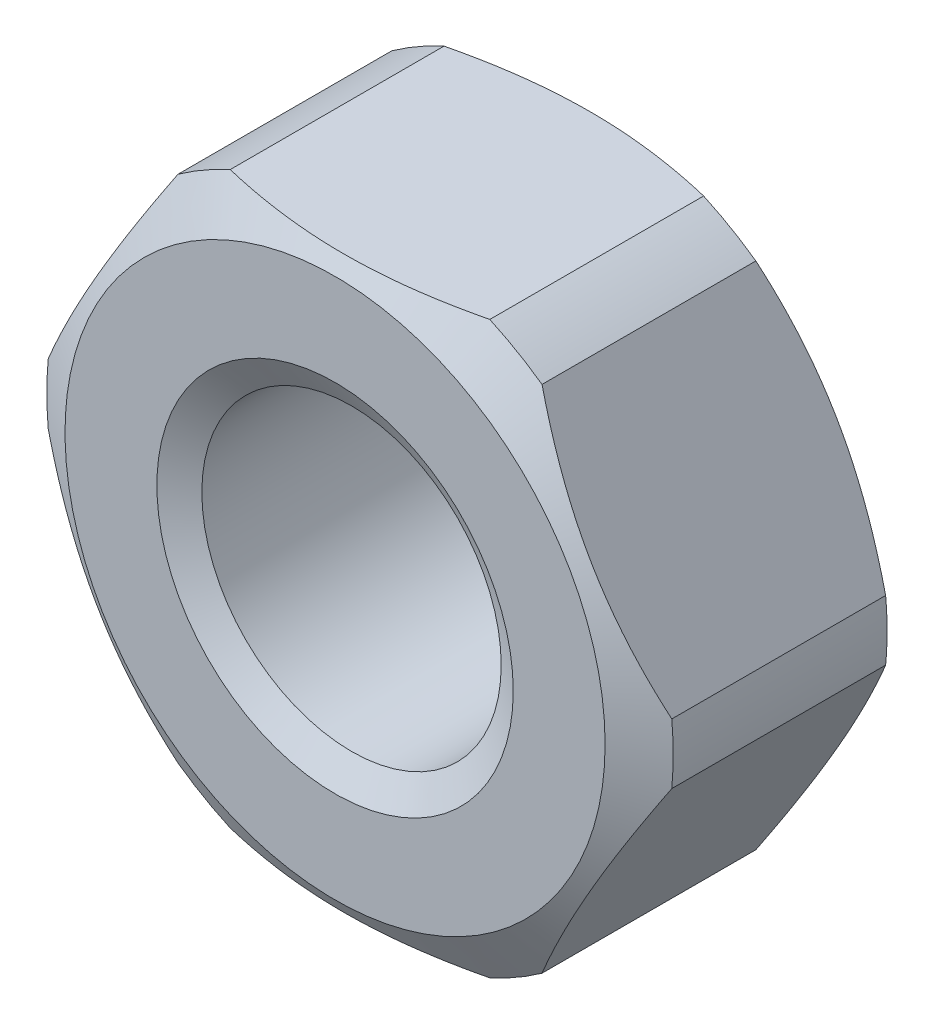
ISO-10303-21;
HEADER;
FILE_DESCRIPTION(('STEP AP214'),'2;1');
FILE_NAME('part.step','',(''),(''),'','','');
FILE_SCHEMA(('AUTOMOTIVE_DESIGN { 1 0 10303 214 1 1 1 1 }'));
ENDSEC;
DATA;
#1=APPLICATION_CONTEXT('core data for automotive mechanical design processes');
#2=APPLICATION_PROTOCOL_DEFINITION('international standard','automotive_design',2000,#1);
#3=PRODUCT_CONTEXT('',#1,'mechanical');
#4=PRODUCT('Part','Part','',(#3));
#5=PRODUCT_RELATED_PRODUCT_CATEGORY('part','',(#4));
#6=PRODUCT_DEFINITION_FORMATION('','',#4);
#7=PRODUCT_DEFINITION_CONTEXT('part definition',#1,'design');
#8=PRODUCT_DEFINITION('design','',#6,#7);
#9=PRODUCT_DEFINITION_SHAPE('','',#8);
#10=(LENGTH_UNIT() NAMED_UNIT(*) SI_UNIT(.MILLI.,.METRE.));
#11=(NAMED_UNIT(*) PLANE_ANGLE_UNIT() SI_UNIT($,.RADIAN.));
#12=(NAMED_UNIT(*) SI_UNIT($,.STERADIAN.) SOLID_ANGLE_UNIT());
#13=UNCERTAINTY_MEASURE_WITH_UNIT(LENGTH_MEASURE(1.E-05),#10,'distance_accuracy_value','');
#14=(GEOMETRIC_REPRESENTATION_CONTEXT(3) GLOBAL_UNCERTAINTY_ASSIGNED_CONTEXT((#13)) GLOBAL_UNIT_ASSIGNED_CONTEXT((#10,
#11,#12)) REPRESENTATION_CONTEXT('',''));
#15=CARTESIAN_POINT('',(0.,0.,0.));
#16=DIRECTION('',(0.,0.,1.));
#17=DIRECTION('',(1.,0.,0.));
#18=AXIS2_PLACEMENT_3D('',#15,#16,#17);
#19=CARTESIAN_POINT('',(0.,0.,-3.7));
#20=DIRECTION('',(0.,0.,1.));
#21=DIRECTION('',(1.,0.,0.));
#22=AXIS2_PLACEMENT_3D('',#19,#20,#21);
#23=CONICAL_SURFACE('',#22,3.78878221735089,1.0471975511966);
#24=CARTESIAN_POINT('',(0.,0.,-3.7));
#25=DIRECTION('',(0.,0.,1.));
#26=DIRECTION('',(1.,0.,0.));
#27=AXIS2_PLACEMENT_3D('',#24,#25,#26);
#28=CIRCLE('',#27,3.78878221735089);
#29=CARTESIAN_POINT('',(3.78878221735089,0.,-3.7));
#30=VERTEX_POINT('',#29);
#31=EDGE_CURVE('E162',#30,#30,#28,.T.);
#32=ORIENTED_EDGE('',*,*,#31,.T.);
#33=EDGE_LOOP('',(#32));
#34=FACE_BOUND('',#33,.T.);
#35=CARTESIAN_POINT('',(-6.09010462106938,-4.,-1.68073860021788));
#36=CARTESIAN_POINT('',(-5.91474984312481,-4.,-1.76533469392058));
#37=CARTESIAN_POINT('',(-5.73897650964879,-4.,-1.84907910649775));
#38=CARTESIAN_POINT('',(-5.38636624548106,-4.,-2.01437706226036));
#39=CARTESIAN_POINT('',(-5.20952913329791,-4.,-2.09593021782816));
#40=CARTESIAN_POINT('',(-4.8535922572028,-4.,-2.25679540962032));
#41=CARTESIAN_POINT('',(-4.67448531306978,-4.,-2.33609161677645));
#42=CARTESIAN_POINT('',(-4.31478640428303,-4.,-2.49122759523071));
#43=CARTESIAN_POINT('',(-4.13419451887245,-4.,-2.56706754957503));
#44=CARTESIAN_POINT('',(-3.76915945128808,-4.,-2.71520441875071));
#45=CARTESIAN_POINT('',(-3.58469582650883,-4.,-2.78745123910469));
#46=CARTESIAN_POINT('',(-3.21358050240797,-4.,-2.92619920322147));
#47=CARTESIAN_POINT('',(-3.02692856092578,-4.,-2.99269970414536));
#48=CARTESIAN_POINT('',(-2.65153478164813,-4.,-3.11814272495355));
#49=CARTESIAN_POINT('',(-2.46279847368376,-4.,-3.17710162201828));
#50=CARTESIAN_POINT('',(-2.08264462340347,-4.,-3.28552421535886));
#51=CARTESIAN_POINT('',(-1.89122795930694,-4.,-3.33499094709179));
#52=CARTESIAN_POINT('',(-1.50556889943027,-4.,-3.4220090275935));
#53=CARTESIAN_POINT('',(-1.31132534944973,-4.,-3.45955535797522));
#54=CARTESIAN_POINT('',(-0.920535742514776,-4.,-3.52017523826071));
#55=CARTESIAN_POINT('',(-0.723989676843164,-4.,-3.54324873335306));
#56=CARTESIAN_POINT('',(-0.330842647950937,-4.,-3.57288099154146));
#57=CARTESIAN_POINT('',(-0.134249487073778,-4.,-3.57954064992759));
#58=CARTESIAN_POINT('',(0.258741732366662,-4.,-3.57600684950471));
#59=CARTESIAN_POINT('',(0.455139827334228,-4.,-3.56581758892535));
#60=CARTESIAN_POINT('',(0.791541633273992,-4.,-3.53464466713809));
#61=CARTESIAN_POINT('',(0.931919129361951,-4.,-3.51748812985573));
#62=CARTESIAN_POINT('',(1.2115657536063,-4.,-3.47570112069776));
#63=CARTESIAN_POINT('',(1.35083470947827,-4.,-3.45106950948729));
#64=CARTESIAN_POINT('',(1.76720669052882,-4.,-3.36719032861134));
#65=CARTESIAN_POINT('',(2.04232775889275,-4.,-3.29801551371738));
#66=CARTESIAN_POINT('',(2.45379715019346,-4.,-3.17903567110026));
#67=CARTESIAN_POINT('',(2.5923011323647,-4.,-3.13626919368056));
#68=CARTESIAN_POINT('',(2.86797080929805,-4.,-3.04654496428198));
#69=CARTESIAN_POINT('',(3.00513638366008,-4.,-2.99958683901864));
#70=CARTESIAN_POINT('',(3.27744406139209,-4.,-2.90248009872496));
#71=CARTESIAN_POINT('',(3.41259322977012,-4.,-2.85235109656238));
#72=CARTESIAN_POINT('',(3.68174668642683,-4.,-2.74923724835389));
#73=CARTESIAN_POINT('',(3.81575135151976,-4.,-2.69625338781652));
#74=CARTESIAN_POINT('',(3.94927494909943,-4.,-2.64211045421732));
#75=B_SPLINE_CURVE_WITH_KNOTS('',3,(#35,#36,#37,#38,#39,#40,#41,#42,#43,#44,#45,#46,#47,#48,#49,
#50,#51,#52,#53,#54,#55,#56,#57,#58,#59,#60,#61,#62,#63,#64,#65,#66,#67,#68,#69,#70,#71,#72,#73,
#74),.UNSPECIFIED.,.F.,.F.,(4,2,2,2,2,2,2,2,2,2,2,2,2,2,2,2,2,2,2,4),(0.,0.584090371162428,
1.16828339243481,1.7558806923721,2.34344683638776,2.93769425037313,3.53200805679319,
4.12500852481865,4.71781904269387,5.31087879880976,5.90394080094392,6.49334807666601,
7.08260851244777,7.50666702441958,7.93079020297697,8.78067929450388,9.21551481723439,
9.65038910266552,10.0827961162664,10.5150548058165),.UNSPECIFIED.);
#76=CARTESIAN_POINT('',(-1.82099560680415,-4.,-3.35));
#77=VERTEX_POINT('',#76);
#78=CARTESIAN_POINT('',(1.82099560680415,-4.,-3.35));
#79=VERTEX_POINT('',#78);
#80=EDGE_CURVE('E318',#77,#79,#75,.T.);
#81=ORIENTED_EDGE('',*,*,#80,.F.);
#82=CARTESIAN_POINT('',(0.,0.,-3.35));
#83=DIRECTION('',(0.,0.,1.));
#84=DIRECTION('',(1.,0.,0.));
#85=AXIS2_PLACEMENT_3D('',#82,#83,#84);
#86=CIRCLE('',#85,4.395);
#87=CARTESIAN_POINT('',(-2.55360381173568,-3.57702845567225,-3.35));
#88=VERTEX_POINT('',#87);
#89=EDGE_CURVE('E306',#88,#77,#86,.T.);
#90=ORIENTED_EDGE('',*,*,#89,.F.);
#91=CARTESIAN_POINT('',(-4.37501737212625,-0.422247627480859,-3.3498));
#92=CARTESIAN_POINT('',(-4.32612550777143,-0.506930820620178,-3.37319909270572));
#93=CARTESIAN_POINT('',(-4.27705778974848,-0.591918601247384,-3.39512338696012));
#94=CARTESIAN_POINT('',(-4.17857058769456,-0.762503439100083,-3.43569438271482));
#95=CARTESIAN_POINT('',(-4.12915100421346,-0.848100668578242,-3.45434011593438));
#96=CARTESIAN_POINT('',(-3.98032099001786,-1.10588181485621,-3.50487711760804));
#97=CARTESIAN_POINT('',(-3.88042496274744,-1.27890680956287,-3.53132603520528));
#98=CARTESIAN_POINT('',(-3.68182029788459,-1.62290017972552,-3.56711618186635));
#99=CARTESIAN_POINT('',(-3.5831263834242,-1.79384305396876,-3.57678031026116));
#100=CARTESIAN_POINT('',(-3.38575172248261,-2.13570599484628,-3.57908761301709));
#101=CARTESIAN_POINT('',(-3.28707102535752,-2.30662597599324,-3.57174400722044));
#102=CARTESIAN_POINT('',(-3.13547487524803,-2.56919821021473,-3.54788416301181));
#103=CARTESIAN_POINT('',(-3.08231309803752,-2.66127710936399,-3.53711457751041));
#104=CARTESIAN_POINT('',(-2.97625782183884,-2.84497023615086,-3.51109560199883));
#105=CARTESIAN_POINT('',(-2.92336434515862,-2.93658442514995,-3.49584584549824));
#106=CARTESIAN_POINT('',(-2.81734845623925,-3.12020933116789,-3.46102286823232));
#107=CARTESIAN_POINT('',(-2.76422979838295,-3.21221354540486,-3.44140448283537));
#108=CARTESIAN_POINT('',(-2.6583990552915,-3.39551776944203,-3.39835775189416));
#109=CARTESIAN_POINT('',(-2.60568682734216,-3.48681802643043,-3.37493081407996));
#110=CARTESIAN_POINT('',(-2.55318585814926,-3.57775237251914,-3.3498));
#111=B_SPLINE_CURVE_WITH_KNOTS('',3,(#91,#92,#93,#94,#95,#96,#97,#98,#99,#100,#101,#102,#103,
#104,#105,#106,#107,#108,#109,#110),.UNSPECIFIED.,.F.,.F.,(4,2,2,2,2,2,2,2,2,4),(0.,
0.301613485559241,0.603315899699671,1.20724889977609,1.79942937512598,2.39114971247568,
2.71167001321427,3.03221654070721,3.35624503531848,3.68015403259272),.UNSPECIFIED.);
#112=CARTESIAN_POINT('',(-4.37459941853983,-0.422971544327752,-3.35));
#113=VERTEX_POINT('',#112);
#114=EDGE_CURVE('E242',#113,#88,#111,.T.);
#115=ORIENTED_EDGE('',*,*,#114,.F.);
#116=CARTESIAN_POINT('',(-4.37459941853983,0.422971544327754,-3.35));
#117=VERTEX_POINT('',#116);
#118=EDGE_CURVE('E304',#117,#113,#86,.T.);
#119=ORIENTED_EDGE('',*,*,#118,.F.);
#120=CARTESIAN_POINT('',(-2.55318585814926,3.57775237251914,-3.3498));
#121=CARTESIAN_POINT('',(-2.60207772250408,3.49306917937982,-3.37319909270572));
#122=CARTESIAN_POINT('',(-2.65114544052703,3.40808139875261,-3.39512338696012));
#123=CARTESIAN_POINT('',(-2.74963264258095,3.23749656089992,-3.43569438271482));
#124=CARTESIAN_POINT('',(-2.79905222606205,3.15189933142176,-3.45434011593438));
#125=CARTESIAN_POINT('',(-2.94788224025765,2.89411818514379,-3.50487711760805));
#126=CARTESIAN_POINT('',(-3.04777826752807,2.72109319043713,-3.53132603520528));
#127=CARTESIAN_POINT('',(-3.24638293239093,2.37709982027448,-3.56711618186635));
#128=CARTESIAN_POINT('',(-3.34507684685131,2.20615694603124,-3.57678031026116));
#129=CARTESIAN_POINT('',(-3.5424515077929,1.86429400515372,-3.57908761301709));
#130=CARTESIAN_POINT('',(-3.64113220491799,1.69337402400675,-3.57174400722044));
#131=CARTESIAN_POINT('',(-3.79272835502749,1.43080178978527,-3.5478841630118));
#132=CARTESIAN_POINT('',(-3.84589013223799,1.33872289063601,-3.53711457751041));
#133=CARTESIAN_POINT('',(-3.95194540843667,1.15502976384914,-3.51109560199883));
#134=CARTESIAN_POINT('',(-4.00483888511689,1.06341557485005,-3.49584584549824));
#135=CARTESIAN_POINT('',(-4.11085477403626,0.879790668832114,-3.46102286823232));
#136=CARTESIAN_POINT('',(-4.16397343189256,0.787786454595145,-3.44140448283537));
#137=CARTESIAN_POINT('',(-4.26980417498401,0.604482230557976,-3.39835775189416));
#138=CARTESIAN_POINT('',(-4.32251640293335,0.513181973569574,-3.37493081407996));
#139=CARTESIAN_POINT('',(-4.37501737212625,0.422247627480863,-3.3498));
#140=B_SPLINE_CURVE_WITH_KNOTS('',3,(#120,#121,#122,#123,#124,#125,#126,#127,#128,#129,#130,
#131,#132,#133,#134,#135,#136,#137,#138,#139),.UNSPECIFIED.,.F.,.F.,(4,2,2,2,2,2,2,2,2,4),(0.,
0.301613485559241,0.603315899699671,1.20724889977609,1.79942937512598,2.39114971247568,
2.71167001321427,3.0322165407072,3.35624503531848,3.68015403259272),.UNSPECIFIED.);
#141=CARTESIAN_POINT('',(-2.55360381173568,3.57702845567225,-3.35));
#142=VERTEX_POINT('',#141);
#143=EDGE_CURVE('E234',#142,#117,#140,.T.);
#144=ORIENTED_EDGE('',*,*,#143,.F.);
#145=CARTESIAN_POINT('',(-1.82099560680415,4.,-3.35));
#146=VERTEX_POINT('',#145);
#147=EDGE_CURVE('E298',#146,#142,#86,.T.);
#148=ORIENTED_EDGE('',*,*,#147,.F.);
#149=CARTESIAN_POINT('',(-6.09010462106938,4.,-1.68073860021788));
#150=CARTESIAN_POINT('',(-5.91474984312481,4.,-1.76533469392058));
#151=CARTESIAN_POINT('',(-5.73897650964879,4.,-1.84907910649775));
#152=CARTESIAN_POINT('',(-5.38636624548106,4.,-2.01437706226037));
#153=CARTESIAN_POINT('',(-5.2095291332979,4.,-2.09593021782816));
#154=CARTESIAN_POINT('',(-4.8535922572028,4.,-2.25679540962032));
#155=CARTESIAN_POINT('',(-4.67448531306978,4.,-2.33609161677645));
#156=CARTESIAN_POINT('',(-4.31478640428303,4.,-2.49122759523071));
#157=CARTESIAN_POINT('',(-4.13419451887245,4.,-2.56706754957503));
#158=CARTESIAN_POINT('',(-3.76915945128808,4.,-2.71520441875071));
#159=CARTESIAN_POINT('',(-3.58469582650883,4.,-2.78745123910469));
#160=CARTESIAN_POINT('',(-3.21358050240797,4.,-2.92619920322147));
#161=CARTESIAN_POINT('',(-3.02692856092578,4.,-2.99269970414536));
#162=CARTESIAN_POINT('',(-2.65153478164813,4.,-3.11814272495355));
#163=CARTESIAN_POINT('',(-2.46279847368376,4.,-3.17710162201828));
#164=CARTESIAN_POINT('',(-2.08264462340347,4.,-3.28552421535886));
#165=CARTESIAN_POINT('',(-1.89122795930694,4.,-3.33499094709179));
#166=CARTESIAN_POINT('',(-1.50556889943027,4.,-3.4220090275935));
#167=CARTESIAN_POINT('',(-1.31132534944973,4.,-3.45955535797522));
#168=CARTESIAN_POINT('',(-0.920535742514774,4.,-3.52017523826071));
#169=CARTESIAN_POINT('',(-0.723989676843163,4.,-3.54324873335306));
#170=CARTESIAN_POINT('',(-0.330842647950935,4.,-3.57288099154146));
#171=CARTESIAN_POINT('',(-0.134249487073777,4.,-3.57954064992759));
#172=CARTESIAN_POINT('',(0.258741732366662,4.,-3.57600684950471));
#173=CARTESIAN_POINT('',(0.455139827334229,4.,-3.56581758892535));
#174=CARTESIAN_POINT('',(0.791541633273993,4.,-3.53464466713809));
#175=CARTESIAN_POINT('',(0.931919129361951,4.,-3.51748812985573));
#176=CARTESIAN_POINT('',(1.2115657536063,4.,-3.47570112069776));
#177=CARTESIAN_POINT('',(1.35083470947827,4.,-3.45106950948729));
#178=CARTESIAN_POINT('',(1.76720669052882,4.,-3.36719032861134));
#179=CARTESIAN_POINT('',(2.04232775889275,4.,-3.29801551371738));
#180=CARTESIAN_POINT('',(2.45379715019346,4.,-3.17903567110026));
#181=CARTESIAN_POINT('',(2.59230113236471,4.,-3.13626919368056));
#182=CARTESIAN_POINT('',(2.86797080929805,4.,-3.04654496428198));
#183=CARTESIAN_POINT('',(3.00513638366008,4.,-2.99958683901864));
#184=CARTESIAN_POINT('',(3.27744406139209,4.,-2.90248009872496));
#185=CARTESIAN_POINT('',(3.41259322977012,4.,-2.85235109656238));
#186=CARTESIAN_POINT('',(3.68174668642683,4.,-2.74923724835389));
#187=CARTESIAN_POINT('',(3.81575135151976,4.,-2.69625338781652));
#188=CARTESIAN_POINT('',(3.94927494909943,4.,-2.64211045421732));
#189=B_SPLINE_CURVE_WITH_KNOTS('',3,(#149,#150,#151,#152,#153,#154,#155,#156,#157,#158,#159,
#160,#161,#162,#163,#164,#165,#166,#167,#168,#169,#170,#171,#172,#173,#174,#175,#176,#177,#178,
#179,#180,#181,#182,#183,#184,#185,#186,#187,#188),.UNSPECIFIED.,.F.,.F.,(4,2,2,2,2,2,2,2,2,2,2,
2,2,2,2,2,2,2,2,4),(0.,0.58409037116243,1.16828339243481,1.7558806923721,2.34344683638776,
2.93769425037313,3.53200805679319,4.12500852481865,4.71781904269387,5.31087879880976,
5.90394080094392,6.49334807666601,7.08260851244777,7.50666702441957,7.93079020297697,
8.78067929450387,9.21551481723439,9.65038910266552,10.0827961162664,10.5150548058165),.UNSPECIFIED.);
#190=CARTESIAN_POINT('',(1.82099560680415,4.,-3.35));
#191=VERTEX_POINT('',#190);
#192=EDGE_CURVE('E227',#191,#146,#189,.F.);
#193=ORIENTED_EDGE('',*,*,#192,.F.);
#194=CARTESIAN_POINT('',(2.55360381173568,3.57702845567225,-3.35));
#195=VERTEX_POINT('',#194);
#196=EDGE_CURVE('E161',#195,#191,#86,.T.);
#197=ORIENTED_EDGE('',*,*,#196,.F.);
#198=CARTESIAN_POINT('',(4.37501737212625,0.422247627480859,-3.3498));
#199=CARTESIAN_POINT('',(4.32612550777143,0.506930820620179,-3.37319909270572));
#200=CARTESIAN_POINT('',(4.27705778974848,0.591918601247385,-3.39512338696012));
#201=CARTESIAN_POINT('',(4.17857058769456,0.762503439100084,-3.43569438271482));
#202=CARTESIAN_POINT('',(4.12915100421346,0.848100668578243,-3.45434011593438));
#203=CARTESIAN_POINT('',(3.98032099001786,1.10588181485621,-3.50487711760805));
#204=CARTESIAN_POINT('',(3.88042496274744,1.27890680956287,-3.53132603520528));
#205=CARTESIAN_POINT('',(3.68182029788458,1.62290017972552,-3.56711618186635));
#206=CARTESIAN_POINT('',(3.5831263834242,1.79384305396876,-3.57678031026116));
#207=CARTESIAN_POINT('',(3.38575172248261,2.13570599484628,-3.57908761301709));
#208=CARTESIAN_POINT('',(3.28707102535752,2.30662597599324,-3.57174400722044));
#209=CARTESIAN_POINT('',(3.13547487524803,2.56919821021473,-3.5478841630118));
#210=CARTESIAN_POINT('',(3.08231309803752,2.66127710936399,-3.53711457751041));
#211=CARTESIAN_POINT('',(2.97625782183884,2.84497023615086,-3.51109560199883));
#212=CARTESIAN_POINT('',(2.92336434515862,2.93658442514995,-3.49584584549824));
#213=CARTESIAN_POINT('',(2.81734845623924,3.12020933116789,-3.46102286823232));
#214=CARTESIAN_POINT('',(2.76422979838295,3.21221354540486,-3.44140448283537));
#215=CARTESIAN_POINT('',(2.65839905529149,3.39551776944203,-3.39835775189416));
#216=CARTESIAN_POINT('',(2.60568682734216,3.48681802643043,-3.37493081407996));
#217=CARTESIAN_POINT('',(2.55318585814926,3.57775237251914,-3.3498));
#218=B_SPLINE_CURVE_WITH_KNOTS('',3,(#198,#199,#200,#201,#202,#203,#204,#205,#206,#207,#208,
#209,#210,#211,#212,#213,#214,#215,#216,#217),.UNSPECIFIED.,.F.,.F.,(4,2,2,2,2,2,2,2,2,4),(0.,
0.301613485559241,0.603315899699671,1.20724889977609,1.79942937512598,2.39114971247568,
2.71167001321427,3.03221654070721,3.35624503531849,3.68015403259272),.UNSPECIFIED.);
#219=CARTESIAN_POINT('',(4.37459941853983,0.422971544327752,-3.35));
#220=VERTEX_POINT('',#219);
#221=EDGE_CURVE('E220',#220,#195,#218,.T.);
#222=ORIENTED_EDGE('',*,*,#221,.F.);
#223=CARTESIAN_POINT('',(4.37459941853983,-0.42297154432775,-3.35));
#224=VERTEX_POINT('',#223);
#225=EDGE_CURVE('E158',#224,#220,#86,.T.);
#226=ORIENTED_EDGE('',*,*,#225,.F.);
#227=CARTESIAN_POINT('',(2.55318585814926,-3.57775237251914,-3.3498));
#228=CARTESIAN_POINT('',(2.60207772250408,-3.49306917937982,-3.37319909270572));
#229=CARTESIAN_POINT('',(2.65114544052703,-3.40808139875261,-3.39512338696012));
#230=CARTESIAN_POINT('',(2.74963264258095,-3.23749656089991,-3.43569438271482));
#231=CARTESIAN_POINT('',(2.79905222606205,-3.15189933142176,-3.45434011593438));
#232=CARTESIAN_POINT('',(2.94788224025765,-2.89411818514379,-3.50487711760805));
#233=CARTESIAN_POINT('',(3.04777826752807,-2.72109319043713,-3.53132603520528));
#234=CARTESIAN_POINT('',(3.24638293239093,-2.37709982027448,-3.56711618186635));
#235=CARTESIAN_POINT('',(3.34507684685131,-2.20615694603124,-3.57678031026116));
#236=CARTESIAN_POINT('',(3.5424515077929,-1.86429400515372,-3.57908761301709));
#237=CARTESIAN_POINT('',(3.64113220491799,-1.69337402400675,-3.57174400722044));
#238=CARTESIAN_POINT('',(3.79272835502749,-1.43080178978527,-3.5478841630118));
#239=CARTESIAN_POINT('',(3.84589013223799,-1.33872289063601,-3.53711457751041));
#240=CARTESIAN_POINT('',(3.95194540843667,-1.15502976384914,-3.51109560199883));
#241=CARTESIAN_POINT('',(4.00483888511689,-1.06341557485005,-3.49584584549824));
#242=CARTESIAN_POINT('',(4.11085477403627,-0.879790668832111,-3.46102286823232));
#243=CARTESIAN_POINT('',(4.16397343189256,-0.787786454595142,-3.44140448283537));
#244=CARTESIAN_POINT('',(4.26980417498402,-0.604482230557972,-3.39835775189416));
#245=CARTESIAN_POINT('',(4.32251640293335,-0.51318197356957,-3.37493081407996));
#246=CARTESIAN_POINT('',(4.37501737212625,-0.422247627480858,-3.3498));
#247=B_SPLINE_CURVE_WITH_KNOTS('',3,(#227,#228,#229,#230,#231,#232,#233,#234,#235,#236,#237,
#238,#239,#240,#241,#242,#243,#244,#245,#246),.UNSPECIFIED.,.F.,.F.,(4,2,2,2,2,2,2,2,2,4),(0.,
0.301613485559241,0.603315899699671,1.20724889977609,1.79942937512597,2.39114971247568,
2.71167001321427,3.03221654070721,3.35624503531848,3.68015403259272),.UNSPECIFIED.);
#248=CARTESIAN_POINT('',(2.55360381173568,-3.57702845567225,-3.35));
#249=VERTEX_POINT('',#248);
#250=EDGE_CURVE('E199',#249,#224,#247,.T.);
#251=ORIENTED_EDGE('',*,*,#250,.F.);
#252=EDGE_CURVE('E145',#79,#249,#86,.T.);
#253=ORIENTED_EDGE('',*,*,#252,.F.);
#254=EDGE_LOOP('',(#81,#90,#115,#119,#144,#148,#193,#197,#222,#226,#251,#253));
#255=FACE_BOUND('',#254,.T.);
#256=ADVANCED_FACE('F37',(#34,#255),#23,.T.);
#257=CARTESIAN_POINT('',(0.,0.,0.));
#258=DIRECTION('',(0.,0.,1.));
#259=DIRECTION('',(1.,0.,0.));
#260=AXIS2_PLACEMENT_3D('',#257,#258,#259);
#261=CYLINDRICAL_SURFACE('',#260,4.395);
#262=DIRECTION('',(0.,0.,1.));
#263=VECTOR('',#262,1.);
#264=CARTESIAN_POINT('',(1.82099560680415,-4.,0.));
#265=LINE('',#264,#263);
#266=CARTESIAN_POINT('',(1.82099560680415,-4.,-0.349999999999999));
#267=VERTEX_POINT('',#266);
#268=EDGE_CURVE('E64',#79,#267,#265,.T.);
#269=ORIENTED_EDGE('',*,*,#268,.F.);
#270=ORIENTED_EDGE('',*,*,#252,.T.);
#271=DIRECTION('',(0.,0.,1.));
#272=VECTOR('',#271,1.);
#273=CARTESIAN_POINT('',(2.55360381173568,-3.57702845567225,0.));
#274=LINE('',#273,#272);
#275=CARTESIAN_POINT('',(2.55360381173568,-3.57702845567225,-0.349999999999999));
#276=VERTEX_POINT('',#275);
#277=EDGE_CURVE('E130',#276,#249,#274,.F.);
#278=ORIENTED_EDGE('',*,*,#277,.F.);
#279=CARTESIAN_POINT('',(0.,0.,-0.349999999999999));
#280=DIRECTION('',(0.,0.,1.));
#281=DIRECTION('',(1.,0.,0.));
#282=AXIS2_PLACEMENT_3D('',#279,#280,#281);
#283=CIRCLE('',#282,4.395);
#284=EDGE_CURVE('E143',#267,#276,#283,.T.);
#285=ORIENTED_EDGE('',*,*,#284,.F.);
#286=EDGE_LOOP('',(#269,#270,#278,#285));
#287=FACE_BOUND('',#286,.T.);
#288=ADVANCED_FACE('F142',(#287),#261,.T.);
#289=DIRECTION('',(0.,0.,1.));
#290=VECTOR('',#289,1.);
#291=CARTESIAN_POINT('',(-1.82099560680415,-4.,0.));
#292=LINE('',#291,#290);
#293=CARTESIAN_POINT('',(-1.82099560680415,-4.,-0.349999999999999));
#294=VERTEX_POINT('',#293);
#295=EDGE_CURVE('E249',#294,#77,#292,.F.);
#296=ORIENTED_EDGE('',*,*,#295,.F.);
#297=CARTESIAN_POINT('',(-2.55360381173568,-3.57702845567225,-0.349999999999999));
#298=VERTEX_POINT('',#297);
#299=EDGE_CURVE('E149',#298,#294,#283,.T.);
#300=ORIENTED_EDGE('',*,*,#299,.F.);
#301=DIRECTION('',(0.,0.,1.));
#302=VECTOR('',#301,1.);
#303=CARTESIAN_POINT('',(-2.55360381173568,-3.57702845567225,0.));
#304=LINE('',#303,#302);
#305=EDGE_CURVE('E250',#88,#298,#304,.T.);
#306=ORIENTED_EDGE('',*,*,#305,.F.);
#307=ORIENTED_EDGE('',*,*,#89,.T.);
#308=EDGE_LOOP('',(#296,#300,#306,#307));
#309=FACE_BOUND('',#308,.T.);
#310=ADVANCED_FACE('F315',(#309),#261,.T.);
#311=DIRECTION('',(0.,0.,1.));
#312=VECTOR('',#311,1.);
#313=CARTESIAN_POINT('',(-4.37459941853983,-0.422971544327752,0.));
#314=LINE('',#313,#312);
#315=CARTESIAN_POINT('',(-4.37459941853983,-0.422971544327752,-0.349999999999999));
#316=VERTEX_POINT('',#315);
#317=EDGE_CURVE('E364',#316,#113,#314,.F.);
#318=ORIENTED_EDGE('',*,*,#317,.F.);
#319=CARTESIAN_POINT('',(-4.37459941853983,0.422971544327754,-0.349999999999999));
#320=VERTEX_POINT('',#319);
#321=EDGE_CURVE('E152',#320,#316,#283,.T.);
#322=ORIENTED_EDGE('',*,*,#321,.F.);
#323=DIRECTION('',(0.,0.,1.));
#324=VECTOR('',#323,1.);
#325=CARTESIAN_POINT('',(-4.37459941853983,0.422971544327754,0.));
#326=LINE('',#325,#324);
#327=EDGE_CURVE('E375',#117,#320,#326,.T.);
#328=ORIENTED_EDGE('',*,*,#327,.F.);
#329=ORIENTED_EDGE('',*,*,#118,.T.);
#330=EDGE_LOOP('',(#318,#322,#328,#329));
#331=FACE_BOUND('',#330,.T.);
#332=ADVANCED_FACE('F356',(#331),#261,.T.);
#333=DIRECTION('',(0.,0.,1.));
#334=VECTOR('',#333,1.);
#335=CARTESIAN_POINT('',(-2.55360381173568,3.57702845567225,0.));
#336=LINE('',#335,#334);
#337=CARTESIAN_POINT('',(-2.55360381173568,3.57702845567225,-0.349999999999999));
#338=VERTEX_POINT('',#337);
#339=EDGE_CURVE('E292',#338,#142,#336,.F.);
#340=ORIENTED_EDGE('',*,*,#339,.F.);
#341=CARTESIAN_POINT('',(-1.82099560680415,4.,-0.349999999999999));
#342=VERTEX_POINT('',#341);
#343=EDGE_CURVE('E300',#342,#338,#283,.T.);
#344=ORIENTED_EDGE('',*,*,#343,.F.);
#345=DIRECTION('',(0.,0.,1.));
#346=VECTOR('',#345,1.);
#347=CARTESIAN_POINT('',(-1.82099560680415,4.,0.));
#348=LINE('',#347,#346);
#349=EDGE_CURVE('E284',#146,#342,#348,.T.);
#350=ORIENTED_EDGE('',*,*,#349,.F.);
#351=ORIENTED_EDGE('',*,*,#147,.T.);
#352=EDGE_LOOP('',(#340,#344,#350,#351));
#353=FACE_BOUND('',#352,.T.);
#354=ADVANCED_FACE('F297',(#353),#261,.T.);
#355=DIRECTION('',(0.,0.,1.));
#356=VECTOR('',#355,1.);
#357=CARTESIAN_POINT('',(1.82099560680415,4.,0.));
#358=LINE('',#357,#356);
#359=CARTESIAN_POINT('',(1.82099560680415,4.,-0.349999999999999));
#360=VERTEX_POINT('',#359);
#361=EDGE_CURVE('E287',#360,#191,#358,.F.);
#362=ORIENTED_EDGE('',*,*,#361,.F.);
#363=CARTESIAN_POINT('',(2.55360381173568,3.57702845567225,-0.349999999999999));
#364=VERTEX_POINT('',#363);
#365=EDGE_CURVE('E154',#364,#360,#283,.T.);
#366=ORIENTED_EDGE('',*,*,#365,.F.);
#367=DIRECTION('',(0.,0.,1.));
#368=VECTOR('',#367,1.);
#369=CARTESIAN_POINT('',(2.55360381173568,3.57702845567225,0.));
#370=LINE('',#369,#368);
#371=EDGE_CURVE('E372',#195,#364,#370,.T.);
#372=ORIENTED_EDGE('',*,*,#371,.F.);
#373=ORIENTED_EDGE('',*,*,#196,.T.);
#374=EDGE_LOOP('',(#362,#366,#372,#373));
#375=FACE_BOUND('',#374,.T.);
#376=ADVANCED_FACE('F345',(#375),#261,.T.);
#377=DIRECTION('',(0.,0.,1.));
#378=VECTOR('',#377,1.);
#379=CARTESIAN_POINT('',(4.37459941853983,0.422971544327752,0.));
#380=LINE('',#379,#378);
#381=CARTESIAN_POINT('',(4.37459941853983,0.422971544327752,-0.349999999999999));
#382=VERTEX_POINT('',#381);
#383=EDGE_CURVE('E206',#382,#220,#380,.F.);
#384=ORIENTED_EDGE('',*,*,#383,.F.);
#385=CARTESIAN_POINT('',(4.37459941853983,-0.42297154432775,-0.349999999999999));
#386=VERTEX_POINT('',#385);
#387=EDGE_CURVE('E150',#386,#382,#283,.T.);
#388=ORIENTED_EDGE('',*,*,#387,.F.);
#389=DIRECTION('',(0.,0.,1.));
#390=VECTOR('',#389,1.);
#391=CARTESIAN_POINT('',(4.37459941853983,-0.42297154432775,0.));
#392=LINE('',#391,#390);
#393=EDGE_CURVE('E57',#224,#386,#392,.T.);
#394=ORIENTED_EDGE('',*,*,#393,.F.);
#395=ORIENTED_EDGE('',*,*,#225,.T.);
#396=EDGE_LOOP('',(#384,#388,#394,#395));
#397=FACE_BOUND('',#396,.T.);
#398=ADVANCED_FACE('F338',(#397),#261,.T.);
#399=CARTESIAN_POINT('',(0.,0.,-0.349999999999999));
#400=DIRECTION('',(0.,0.,-1.));
#401=DIRECTION('',(-1.,0.,0.));
#402=AXIS2_PLACEMENT_3D('',#399,#400,#401);
#403=CONICAL_SURFACE('',#402,4.395,1.0471975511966);
#404=CARTESIAN_POINT('',(0.,0.,0.));
#405=DIRECTION('',(0.,0.,1.));
#406=DIRECTION('',(1.,0.,0.));
#407=AXIS2_PLACEMENT_3D('',#404,#405,#406);
#408=CIRCLE('',#407,3.78878221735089);
#409=CARTESIAN_POINT('',(3.78878221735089,0.,0.));
#410=VERTEX_POINT('',#409);
#411=EDGE_CURVE('E153',#410,#410,#408,.T.);
#412=ORIENTED_EDGE('',*,*,#411,.F.);
#413=EDGE_LOOP('',(#412));
#414=FACE_BOUND('',#413,.T.);
#415=CARTESIAN_POINT('',(-6.09010462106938,-4.,-2.01926139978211));
#416=CARTESIAN_POINT('',(-5.91474984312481,-4.,-1.93466530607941));
#417=CARTESIAN_POINT('',(-5.73897650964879,-4.,-1.85092089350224));
#418=CARTESIAN_POINT('',(-5.38636624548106,-4.,-1.68562293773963));
#419=CARTESIAN_POINT('',(-5.2095291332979,-4.,-1.60406978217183));
#420=CARTESIAN_POINT('',(-4.8535922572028,-4.,-1.44320459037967));
#421=CARTESIAN_POINT('',(-4.67448531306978,-4.,-1.36390838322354));
#422=CARTESIAN_POINT('',(-4.31478640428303,-4.,-1.20877240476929));
#423=CARTESIAN_POINT('',(-4.13419451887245,-4.,-1.13293245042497));
#424=CARTESIAN_POINT('',(-3.76915945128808,-4.,-0.984795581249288));
#425=CARTESIAN_POINT('',(-3.58469582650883,-4.,-0.912548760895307));
#426=CARTESIAN_POINT('',(-3.21358050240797,-4.,-0.773800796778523));
#427=CARTESIAN_POINT('',(-3.02692856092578,-4.,-0.707300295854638));
#428=CARTESIAN_POINT('',(-2.65153478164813,-4.,-0.581857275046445));
#429=CARTESIAN_POINT('',(-2.46279847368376,-4.,-0.522898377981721));
#430=CARTESIAN_POINT('',(-2.08264462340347,-4.,-0.414475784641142));
#431=CARTESIAN_POINT('',(-1.89122795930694,-4.,-0.36500905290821));
#432=CARTESIAN_POINT('',(-1.50556889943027,-4.,-0.277990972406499));
#433=CARTESIAN_POINT('',(-1.31132534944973,-4.,-0.240444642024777));
#434=CARTESIAN_POINT('',(-0.920535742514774,-4.,-0.179824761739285));
#435=CARTESIAN_POINT('',(-0.723989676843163,-4.,-0.156751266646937));
#436=CARTESIAN_POINT('',(-0.330842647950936,-4.,-0.127119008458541));
#437=CARTESIAN_POINT('',(-0.134249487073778,-4.,-0.120459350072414));
#438=CARTESIAN_POINT('',(0.258741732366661,-4.,-0.12399315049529));
#439=CARTESIAN_POINT('',(0.455139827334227,-4.,-0.13418241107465));
#440=CARTESIAN_POINT('',(0.791541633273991,-4.,-0.165355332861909));
#441=CARTESIAN_POINT('',(0.93191912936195,-4.,-0.182511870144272));
#442=CARTESIAN_POINT('',(1.2115657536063,-4.,-0.224298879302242));
#443=CARTESIAN_POINT('',(1.35083470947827,-4.,-0.248930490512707));
#444=CARTESIAN_POINT('',(1.76720669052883,-4.,-0.332809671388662));
#445=CARTESIAN_POINT('',(2.04232775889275,-4.,-0.40198448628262));
#446=CARTESIAN_POINT('',(2.45379715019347,-4.,-0.52096432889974));
#447=CARTESIAN_POINT('',(2.59230113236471,-4.,-0.563730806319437));
#448=CARTESIAN_POINT('',(2.86797080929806,-4.,-0.653455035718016));
#449=CARTESIAN_POINT('',(3.00513638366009,-4.,-0.70041316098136));
#450=CARTESIAN_POINT('',(3.2774440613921,-4.,-0.797519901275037));
#451=CARTESIAN_POINT('',(3.41259322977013,-4.,-0.847648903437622));
#452=CARTESIAN_POINT('',(3.68174668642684,-4.,-0.950762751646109));
#453=CARTESIAN_POINT('',(3.81575135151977,-4.,-1.00374661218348));
#454=CARTESIAN_POINT('',(3.94927494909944,-4.,-1.05788954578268));
#455=B_SPLINE_CURVE_WITH_KNOTS('',3,(#415,#416,#417,#418,#419,#420,#421,#422,#423,#424,#425,
#426,#427,#428,#429,#430,#431,#432,#433,#434,#435,#436,#437,#438,#439,#440,#441,#442,#443,#444,
#445,#446,#447,#448,#449,#450,#451,#452,#453,#454),.UNSPECIFIED.,.F.,.F.,(4,2,2,2,2,2,2,2,2,2,2,
2,2,2,2,2,2,2,2,4),(0.,0.58409037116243,1.16828339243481,1.7558806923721,2.34344683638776,
2.93769425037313,3.53200805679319,4.12500852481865,4.71781904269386,5.31087879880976,
5.90394080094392,6.493348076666,7.08260851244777,7.50666702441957,7.93079020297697,
8.78067929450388,9.2155148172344,9.65038910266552,10.0827961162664,10.5150548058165),.UNSPECIFIED.);
#456=EDGE_CURVE('E12',#267,#294,#455,.F.);
#457=ORIENTED_EDGE('',*,*,#456,.F.);
#458=ORIENTED_EDGE('',*,*,#284,.T.);
#459=CARTESIAN_POINT('',(4.37501737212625,-0.42224762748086,-0.350199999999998));
#460=CARTESIAN_POINT('',(4.32612550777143,-0.50693082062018,-0.326800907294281));
#461=CARTESIAN_POINT('',(4.27705778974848,-0.591918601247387,-0.304876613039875));
#462=CARTESIAN_POINT('',(4.17857058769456,-0.762503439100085,-0.264305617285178));
#463=CARTESIAN_POINT('',(4.12915100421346,-0.848100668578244,-0.245659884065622));
#464=CARTESIAN_POINT('',(3.98032099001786,-1.10588181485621,-0.195122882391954));
#465=CARTESIAN_POINT('',(3.88042496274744,-1.27890680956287,-0.168673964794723));
#466=CARTESIAN_POINT('',(3.68182029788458,-1.62290017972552,-0.132883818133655));
#467=CARTESIAN_POINT('',(3.5831263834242,-1.79384305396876,-0.123219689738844));
#468=CARTESIAN_POINT('',(3.38575172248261,-2.13570599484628,-0.120912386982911));
#469=CARTESIAN_POINT('',(3.28707102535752,-2.30662597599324,-0.128255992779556));
#470=CARTESIAN_POINT('',(3.13547487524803,-2.56919821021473,-0.152115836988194));
#471=CARTESIAN_POINT('',(3.08231309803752,-2.66127710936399,-0.162885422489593));
#472=CARTESIAN_POINT('',(2.97625782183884,-2.84497023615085,-0.188904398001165));
#473=CARTESIAN_POINT('',(2.92336434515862,-2.93658442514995,-0.204154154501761));
#474=CARTESIAN_POINT('',(2.81734845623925,-3.12020933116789,-0.238977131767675));
#475=CARTESIAN_POINT('',(2.76422979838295,-3.21221354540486,-0.258595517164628));
#476=CARTESIAN_POINT('',(2.6583990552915,-3.39551776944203,-0.301642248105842));
#477=CARTESIAN_POINT('',(2.60568682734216,-3.48681802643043,-0.325069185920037));
#478=CARTESIAN_POINT('',(2.55318585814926,-3.57775237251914,-0.350199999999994));
#479=B_SPLINE_CURVE_WITH_KNOTS('',3,(#459,#460,#461,#462,#463,#464,#465,#466,#467,#468,#469,
#470,#471,#472,#473,#474,#475,#476,#477,#478),.UNSPECIFIED.,.F.,.F.,(4,2,2,2,2,2,2,2,2,4),(0.,
0.301613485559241,0.60331589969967,1.20724889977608,1.79942937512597,2.39114971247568,
2.71167001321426,3.0322165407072,3.35624503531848,3.68015403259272),.UNSPECIFIED.);
#480=EDGE_CURVE('E127',#386,#276,#479,.T.);
#481=ORIENTED_EDGE('',*,*,#480,.F.);
#482=ORIENTED_EDGE('',*,*,#387,.T.);
#483=CARTESIAN_POINT('',(2.55318585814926,3.57775237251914,-0.350199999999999));
#484=CARTESIAN_POINT('',(2.60207772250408,3.49306917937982,-0.326800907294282));
#485=CARTESIAN_POINT('',(2.65114544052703,3.40808139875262,-0.304876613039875));
#486=CARTESIAN_POINT('',(2.74963264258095,3.23749656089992,-0.264305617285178));
#487=CARTESIAN_POINT('',(2.79905222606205,3.15189933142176,-0.245659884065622));
#488=CARTESIAN_POINT('',(2.94788224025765,2.89411818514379,-0.195122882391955));
#489=CARTESIAN_POINT('',(3.04777826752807,2.72109319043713,-0.168673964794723));
#490=CARTESIAN_POINT('',(3.24638293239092,2.37709982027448,-0.132883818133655));
#491=CARTESIAN_POINT('',(3.34507684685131,2.20615694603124,-0.123219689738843));
#492=CARTESIAN_POINT('',(3.5424515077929,1.86429400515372,-0.120912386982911));
#493=CARTESIAN_POINT('',(3.64113220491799,1.69337402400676,-0.128255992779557));
#494=CARTESIAN_POINT('',(3.79272835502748,1.43080178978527,-0.152115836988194));
#495=CARTESIAN_POINT('',(3.84589013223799,1.33872289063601,-0.162885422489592));
#496=CARTESIAN_POINT('',(3.95194540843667,1.15502976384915,-0.188904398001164));
#497=CARTESIAN_POINT('',(4.00483888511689,1.06341557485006,-0.204154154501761));
#498=CARTESIAN_POINT('',(4.11085477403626,0.879790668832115,-0.238977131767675));
#499=CARTESIAN_POINT('',(4.16397343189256,0.787786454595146,-0.258595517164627));
#500=CARTESIAN_POINT('',(4.26980417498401,0.604482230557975,-0.301642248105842));
#501=CARTESIAN_POINT('',(4.32251640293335,0.513181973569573,-0.325069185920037));
#502=CARTESIAN_POINT('',(4.37501737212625,0.422247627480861,-0.350199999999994));
#503=B_SPLINE_CURVE_WITH_KNOTS('',3,(#483,#484,#485,#486,#487,#488,#489,#490,#491,#492,#493,
#494,#495,#496,#497,#498,#499,#500,#501,#502),.UNSPECIFIED.,.F.,.F.,(4,2,2,2,2,2,2,2,2,4),(0.,
0.301613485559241,0.603315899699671,1.20724889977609,1.79942937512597,2.39114971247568,
2.71167001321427,3.0322165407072,3.35624503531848,3.68015403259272),.UNSPECIFIED.);
#504=EDGE_CURVE('E136',#364,#382,#503,.T.);
#505=ORIENTED_EDGE('',*,*,#504,.F.);
#506=ORIENTED_EDGE('',*,*,#365,.T.);
#507=CARTESIAN_POINT('',(-6.09010462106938,4.,-2.01926139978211));
#508=CARTESIAN_POINT('',(-5.91474984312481,4.,-1.93466530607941));
#509=CARTESIAN_POINT('',(-5.73897650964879,4.,-1.85092089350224));
#510=CARTESIAN_POINT('',(-5.38636624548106,4.,-1.68562293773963));
#511=CARTESIAN_POINT('',(-5.2095291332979,4.,-1.60406978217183));
#512=CARTESIAN_POINT('',(-4.8535922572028,4.,-1.44320459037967));
#513=CARTESIAN_POINT('',(-4.67448531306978,4.,-1.36390838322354));
#514=CARTESIAN_POINT('',(-4.31478640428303,4.,-1.20877240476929));
#515=CARTESIAN_POINT('',(-4.13419451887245,4.,-1.13293245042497));
#516=CARTESIAN_POINT('',(-3.76915945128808,4.,-0.984795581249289));
#517=CARTESIAN_POINT('',(-3.58469582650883,4.,-0.912548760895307));
#518=CARTESIAN_POINT('',(-3.21358050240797,4.,-0.773800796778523));
#519=CARTESIAN_POINT('',(-3.02692856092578,4.,-0.707300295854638));
#520=CARTESIAN_POINT('',(-2.65153478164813,4.,-0.581857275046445));
#521=CARTESIAN_POINT('',(-2.46279847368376,4.,-0.522898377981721));
#522=CARTESIAN_POINT('',(-2.08264462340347,4.,-0.414475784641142));
#523=CARTESIAN_POINT('',(-1.89122795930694,4.,-0.36500905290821));
#524=CARTESIAN_POINT('',(-1.50556889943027,4.,-0.277990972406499));
#525=CARTESIAN_POINT('',(-1.31132534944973,4.,-0.240444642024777));
#526=CARTESIAN_POINT('',(-0.920535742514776,4.,-0.179824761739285));
#527=CARTESIAN_POINT('',(-0.723989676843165,4.,-0.156751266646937));
#528=CARTESIAN_POINT('',(-0.330842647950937,4.,-0.127119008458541));
#529=CARTESIAN_POINT('',(-0.134249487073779,4.,-0.120459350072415));
#530=CARTESIAN_POINT('',(0.258741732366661,4.,-0.12399315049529));
#531=CARTESIAN_POINT('',(0.455139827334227,4.,-0.13418241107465));
#532=CARTESIAN_POINT('',(0.791541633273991,4.,-0.165355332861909));
#533=CARTESIAN_POINT('',(0.931919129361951,4.,-0.182511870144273));
#534=CARTESIAN_POINT('',(1.2115657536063,4.,-0.224298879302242));
#535=CARTESIAN_POINT('',(1.35083470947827,4.,-0.248930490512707));
#536=CARTESIAN_POINT('',(1.76720669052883,4.,-0.332809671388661));
#537=CARTESIAN_POINT('',(2.04232775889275,4.,-0.40198448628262));
#538=CARTESIAN_POINT('',(2.45379715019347,4.,-0.520964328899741));
#539=CARTESIAN_POINT('',(2.59230113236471,4.,-0.563730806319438));
#540=CARTESIAN_POINT('',(2.86797080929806,4.,-0.653455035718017));
#541=CARTESIAN_POINT('',(3.00513638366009,4.,-0.700413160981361));
#542=CARTESIAN_POINT('',(3.2774440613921,4.,-0.797519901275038));
#543=CARTESIAN_POINT('',(3.41259322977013,4.,-0.847648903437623));
#544=CARTESIAN_POINT('',(3.68174668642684,4.,-0.950762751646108));
#545=CARTESIAN_POINT('',(3.81575135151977,4.,-1.00374661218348));
#546=CARTESIAN_POINT('',(3.94927494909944,4.,-1.05788954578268));
#547=B_SPLINE_CURVE_WITH_KNOTS('',3,(#507,#508,#509,#510,#511,#512,#513,#514,#515,#516,#517,
#518,#519,#520,#521,#522,#523,#524,#525,#526,#527,#528,#529,#530,#531,#532,#533,#534,#535,#536,
#537,#538,#539,#540,#541,#542,#543,#544,#545,#546),.UNSPECIFIED.,.F.,.F.,(4,2,2,2,2,2,2,2,2,2,2,
2,2,2,2,2,2,2,2,4),(0.,0.584090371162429,1.16828339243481,1.7558806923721,2.34344683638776,
2.93769425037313,3.53200805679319,4.12500852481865,4.71781904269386,5.31087879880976,
5.90394080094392,6.493348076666,7.08260851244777,7.50666702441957,7.93079020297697,
8.78067929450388,9.2155148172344,9.65038910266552,10.0827961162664,10.5150548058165),.UNSPECIFIED.);
#548=EDGE_CURVE('E267',#342,#360,#547,.T.);
#549=ORIENTED_EDGE('',*,*,#548,.F.);
#550=ORIENTED_EDGE('',*,*,#343,.T.);
#551=CARTESIAN_POINT('',(-4.37501737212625,0.422247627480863,-0.350199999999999));
#552=CARTESIAN_POINT('',(-4.32612550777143,0.506930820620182,-0.326800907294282));
#553=CARTESIAN_POINT('',(-4.27705778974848,0.591918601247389,-0.304876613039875));
#554=CARTESIAN_POINT('',(-4.17857058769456,0.762503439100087,-0.264305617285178));
#555=CARTESIAN_POINT('',(-4.12915100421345,0.848100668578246,-0.245659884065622));
#556=CARTESIAN_POINT('',(-3.98032099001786,1.10588181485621,-0.195122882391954));
#557=CARTESIAN_POINT('',(-3.88042496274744,1.27890680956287,-0.168673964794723));
#558=CARTESIAN_POINT('',(-3.68182029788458,1.62290017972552,-0.132883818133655));
#559=CARTESIAN_POINT('',(-3.5831263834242,1.79384305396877,-0.123219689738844));
#560=CARTESIAN_POINT('',(-3.38575172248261,2.13570599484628,-0.120912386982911));
#561=CARTESIAN_POINT('',(-3.28707102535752,2.30662597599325,-0.128255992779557));
#562=CARTESIAN_POINT('',(-3.13547487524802,2.56919821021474,-0.152115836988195));
#563=CARTESIAN_POINT('',(-3.08231309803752,2.66127710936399,-0.162885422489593));
#564=CARTESIAN_POINT('',(-2.97625782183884,2.84497023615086,-0.188904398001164));
#565=CARTESIAN_POINT('',(-2.92336434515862,2.93658442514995,-0.204154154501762));
#566=CARTESIAN_POINT('',(-2.81734845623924,3.12020933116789,-0.238977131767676));
#567=CARTESIAN_POINT('',(-2.76422979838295,3.21221354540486,-0.258595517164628));
#568=CARTESIAN_POINT('',(-2.65839905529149,3.39551776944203,-0.301642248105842));
#569=CARTESIAN_POINT('',(-2.60568682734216,3.48681802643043,-0.325069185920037));
#570=CARTESIAN_POINT('',(-2.55318585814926,3.57775237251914,-0.350199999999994));
#571=B_SPLINE_CURVE_WITH_KNOTS('',3,(#551,#552,#553,#554,#555,#556,#557,#558,#559,#560,#561,
#562,#563,#564,#565,#566,#567,#568,#569,#570),.UNSPECIFIED.,.F.,.F.,(4,2,2,2,2,2,2,2,2,4),(0.,
0.301613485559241,0.603315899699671,1.20724889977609,1.79942937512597,2.39114971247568,
2.71167001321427,3.0322165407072,3.35624503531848,3.68015403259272),.UNSPECIFIED.);
#572=EDGE_CURVE('E263',#320,#338,#571,.T.);
#573=ORIENTED_EDGE('',*,*,#572,.F.);
#574=ORIENTED_EDGE('',*,*,#321,.T.);
#575=CARTESIAN_POINT('',(-2.55318585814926,-3.57775237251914,-0.350199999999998));
#576=CARTESIAN_POINT('',(-2.60207772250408,-3.49306917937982,-0.326800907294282));
#577=CARTESIAN_POINT('',(-2.65114544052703,-3.40808139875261,-0.304876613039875));
#578=CARTESIAN_POINT('',(-2.74963264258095,-3.23749656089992,-0.264305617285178));
#579=CARTESIAN_POINT('',(-2.79905222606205,-3.15189933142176,-0.245659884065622));
#580=CARTESIAN_POINT('',(-2.94788224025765,-2.89411818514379,-0.195122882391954));
#581=CARTESIAN_POINT('',(-3.04777826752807,-2.72109319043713,-0.168673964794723));
#582=CARTESIAN_POINT('',(-3.24638293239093,-2.37709982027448,-0.132883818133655));
#583=CARTESIAN_POINT('',(-3.34507684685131,-2.20615694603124,-0.123219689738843));
#584=CARTESIAN_POINT('',(-3.5424515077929,-1.86429400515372,-0.120912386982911));
#585=CARTESIAN_POINT('',(-3.64113220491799,-1.69337402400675,-0.128255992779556));
#586=CARTESIAN_POINT('',(-3.79272835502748,-1.43080178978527,-0.152115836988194));
#587=CARTESIAN_POINT('',(-3.84589013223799,-1.33872289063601,-0.162885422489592));
#588=CARTESIAN_POINT('',(-3.95194540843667,-1.15502976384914,-0.188904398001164));
#589=CARTESIAN_POINT('',(-4.00483888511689,-1.06341557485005,-0.204154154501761));
#590=CARTESIAN_POINT('',(-4.11085477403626,-0.879790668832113,-0.238977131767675));
#591=CARTESIAN_POINT('',(-4.16397343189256,-0.787786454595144,-0.258595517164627));
#592=CARTESIAN_POINT('',(-4.26980417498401,-0.604482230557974,-0.301642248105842));
#593=CARTESIAN_POINT('',(-4.32251640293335,-0.513181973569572,-0.325069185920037));
#594=CARTESIAN_POINT('',(-4.37501737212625,-0.422247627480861,-0.350199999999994));
#595=B_SPLINE_CURVE_WITH_KNOTS('',3,(#575,#576,#577,#578,#579,#580,#581,#582,#583,#584,#585,
#586,#587,#588,#589,#590,#591,#592,#593,#594),.UNSPECIFIED.,.F.,.F.,(4,2,2,2,2,2,2,2,2,4),(0.,
0.301613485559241,0.60331589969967,1.20724889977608,1.79942937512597,2.39114971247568,
2.71167001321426,3.0322165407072,3.35624503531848,3.68015403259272),.UNSPECIFIED.);
#596=EDGE_CURVE('E50',#298,#316,#595,.T.);
#597=ORIENTED_EDGE('',*,*,#596,.F.);
#598=ORIENTED_EDGE('',*,*,#299,.T.);
#599=EDGE_LOOP('',(#457,#458,#481,#482,#505,#506,#549,#550,#573,#574,#597,#598));
#600=FACE_BOUND('',#599,.T.);
#601=ADVANCED_FACE('F147',(#414,#600),#403,.T.);
#602=CARTESIAN_POINT('',(0.,0.,-3.46905989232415));
#603=DIRECTION('',(0.,0.,-1.));
#604=DIRECTION('',(-1.,0.,0.));
#605=AXIS2_PLACEMENT_3D('',#602,#603,#604);
#606=CONICAL_SURFACE('',#605,2.1,1.04719755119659);
#607=CARTESIAN_POINT('',(0.,0.,-3.6942264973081));
#608=DIRECTION('',(0.,0.,1.));
#609=DIRECTION('',(1.,0.,0.));
#610=AXIS2_PLACEMENT_3D('',#607,#608,#609);
#611=CIRCLE('',#610,2.49);
#612=CARTESIAN_POINT('',(2.49,0.,-3.6942264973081));
#613=VERTEX_POINT('',#612);
#614=EDGE_CURVE('E137',#613,#613,#611,.T.);
#615=ORIENTED_EDGE('',*,*,#614,.F.);
#616=EDGE_LOOP('',(#615));
#617=FACE_BOUND('',#616,.T.);
#618=CARTESIAN_POINT('',(0.,0.,-3.46905989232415));
#619=DIRECTION('',(0.,0.,1.));
#620=DIRECTION('',(1.,0.,0.));
#621=AXIS2_PLACEMENT_3D('',#618,#619,#620);
#622=CIRCLE('',#621,2.1);
#623=CARTESIAN_POINT('',(2.1,0.,-3.46905989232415));
#624=VERTEX_POINT('',#623);
#625=EDGE_CURVE('E319',#624,#624,#622,.T.);
#626=ORIENTED_EDGE('',*,*,#625,.T.);
#627=EDGE_LOOP('',(#626));
#628=FACE_BOUND('',#627,.T.);
#629=ADVANCED_FACE('F39',(#617,#628),#606,.F.);
#630=CARTESIAN_POINT('',(0.,0.,0.));
#631=DIRECTION('',(0.,0.,1.));
#632=DIRECTION('',(1.,0.,0.));
#633=AXIS2_PLACEMENT_3D('',#630,#631,#632);
#634=CYLINDRICAL_SURFACE('',#633,2.49);
#635=CARTESIAN_POINT('',(0.,0.,-0.0173205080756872));
#636=DIRECTION('',(0.,0.,1.));
#637=DIRECTION('',(1.,0.,0.));
#638=AXIS2_PLACEMENT_3D('',#635,#636,#637);
#639=CIRCLE('',#638,2.49);
#640=CARTESIAN_POINT('',(2.49,0.,-0.0173205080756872));
#641=VERTEX_POINT('',#640);
#642=EDGE_CURVE('E171',#641,#641,#639,.T.);
#643=ORIENTED_EDGE('',*,*,#642,.F.);
#644=EDGE_LOOP('',(#643));
#645=FACE_BOUND('',#644,.T.);
#646=ORIENTED_EDGE('',*,*,#614,.T.);
#647=EDGE_LOOP('',(#646));
#648=FACE_BOUND('',#647,.T.);
#649=ADVANCED_FACE('F343',(#645,#648),#634,.T.);
#650=CARTESIAN_POINT('',(0.,0.,-0.0173205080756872));
#651=DIRECTION('',(0.,0.,1.));
#652=DIRECTION('',(1.,0.,0.));
#653=AXIS2_PLACEMENT_3D('',#650,#651,#652);
#654=CONICAL_SURFACE('',#653,2.49,1.0471975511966);
#655=CARTESIAN_POINT('',(0.,0.,-0.0115470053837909));
#656=DIRECTION('',(0.,0.,1.));
#657=DIRECTION('',(1.,0.,0.));
#658=AXIS2_PLACEMENT_3D('',#655,#656,#657);
#659=CIRCLE('',#658,2.5);
#660=CARTESIAN_POINT('',(2.5,0.,-0.0115470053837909));
#661=VERTEX_POINT('',#660);
#662=EDGE_CURVE('E168',#661,#661,#659,.T.);
#663=ORIENTED_EDGE('',*,*,#662,.F.);
#664=EDGE_LOOP('',(#663));
#665=FACE_BOUND('',#664,.T.);
#666=ORIENTED_EDGE('',*,*,#642,.T.);
#667=EDGE_LOOP('',(#666));
#668=FACE_BOUND('',#667,.T.);
#669=ADVANCED_FACE('F462',(#665,#668),#654,.T.);
#670=CARTESIAN_POINT('',(0.,0.,0.));
#671=DIRECTION('',(0.,0.,1.));
#672=DIRECTION('',(1.,0.,0.));
#673=AXIS2_PLACEMENT_3D('',#670,#671,#672);
#674=CYLINDRICAL_SURFACE('',#673,2.5);
#675=CARTESIAN_POINT('',(0.,0.,-3.7));
#676=DIRECTION('',(0.,0.,1.));
#677=DIRECTION('',(1.,0.,0.));
#678=AXIS2_PLACEMENT_3D('',#675,#676,#677);
#679=CIRCLE('',#678,2.5);
#680=CARTESIAN_POINT('',(2.5,0.,-3.7));
#681=VERTEX_POINT('',#680);
#682=EDGE_CURVE('E165',#681,#681,#679,.T.);
#683=ORIENTED_EDGE('',*,*,#682,.F.);
#684=EDGE_LOOP('',(#683));
#685=FACE_BOUND('',#684,.T.);
#686=ORIENTED_EDGE('',*,*,#662,.T.);
#687=EDGE_LOOP('',(#686));
#688=FACE_BOUND('',#687,.T.);
#689=ADVANCED_FACE('F455',(#685,#688),#674,.F.);
#690=CARTESIAN_POINT('',(0.,2.5,-3.7));
#691=DIRECTION('',(0.,0.,1.));
#692=DIRECTION('',(1.,0.,0.));
#693=AXIS2_PLACEMENT_3D('',#690,#691,#692);
#694=PLANE('',#693);
#695=ORIENTED_EDGE('',*,*,#31,.F.);
#696=EDGE_LOOP('',(#695));
#697=FACE_BOUND('',#696,.T.);
#698=ORIENTED_EDGE('',*,*,#682,.T.);
#699=EDGE_LOOP('',(#698));
#700=FACE_BOUND('',#699,.T.);
#701=ADVANCED_FACE('F212',(#697,#700),#694,.F.);
#702=CARTESIAN_POINT('',(0.,2.5,0.));
#703=DIRECTION('',(0.,0.,-1.));
#704=DIRECTION('',(-1.,0.,0.));
#705=AXIS2_PLACEMENT_3D('',#702,#703,#704);
#706=PLANE('',#705);
#707=CARTESIAN_POINT('',(0.,0.,0.));
#708=DIRECTION('',(0.,0.,1.));
#709=DIRECTION('',(1.,0.,0.));
#710=AXIS2_PLACEMENT_3D('',#707,#708,#709);
#711=CIRCLE('',#710,2.5);
#712=CARTESIAN_POINT('',(2.5,0.,0.));
#713=VERTEX_POINT('',#712);
#714=EDGE_CURVE('E328',#713,#713,#711,.T.);
#715=ORIENTED_EDGE('',*,*,#714,.F.);
#716=EDGE_LOOP('',(#715));
#717=FACE_BOUND('',#716,.T.);
#718=ORIENTED_EDGE('',*,*,#411,.T.);
#719=EDGE_LOOP('',(#718));
#720=FACE_BOUND('',#719,.T.);
#721=ADVANCED_FACE('F335',(#717,#720),#706,.F.);
#722=CARTESIAN_POINT('',(0.,0.,0.));
#723=DIRECTION('',(0.,0.,1.));
#724=DIRECTION('',(1.,0.,0.));
#725=AXIS2_PLACEMENT_3D('',#722,#723,#724);
#726=CONICAL_SURFACE('',#725,2.5,1.0471975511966);
#727=CARTESIAN_POINT('',(0.,0.,-0.230940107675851));
#728=DIRECTION('',(0.,0.,1.));
#729=DIRECTION('',(1.,0.,0.));
#730=AXIS2_PLACEMENT_3D('',#727,#728,#729);
#731=CIRCLE('',#730,2.1);
#732=CARTESIAN_POINT('',(2.1,0.,-0.230940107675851));
#733=VERTEX_POINT('',#732);
#734=EDGE_CURVE('E321',#733,#733,#731,.T.);
#735=ORIENTED_EDGE('',*,*,#734,.F.);
#736=EDGE_LOOP('',(#735));
#737=FACE_BOUND('',#736,.T.);
#738=ORIENTED_EDGE('',*,*,#714,.T.);
#739=EDGE_LOOP('',(#738));
#740=FACE_BOUND('',#739,.T.);
#741=ADVANCED_FACE('F435',(#737,#740),#726,.F.);
#742=CARTESIAN_POINT('',(0.,0.,0.));
#743=DIRECTION('',(0.,0.,1.));
#744=DIRECTION('',(1.,0.,0.));
#745=AXIS2_PLACEMENT_3D('',#742,#743,#744);
#746=CYLINDRICAL_SURFACE('',#745,2.1);
#747=ORIENTED_EDGE('',*,*,#625,.F.);
#748=EDGE_LOOP('',(#747));
#749=FACE_BOUND('',#748,.T.);
#750=ORIENTED_EDGE('',*,*,#734,.T.);
#751=EDGE_LOOP('',(#750));
#752=FACE_BOUND('',#751,.T.);
#753=ADVANCED_FACE('F191',(#749,#752),#746,.F.);
#754=CARTESIAN_POINT('',(2.3094010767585,-4.,-3.7));
#755=DIRECTION('',(0.866025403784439,-0.5,0.));
#756=DIRECTION('',(0.5,0.866025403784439,0.));
#757=AXIS2_PLACEMENT_3D('',#754,#755,#756);
#758=PLANE('',#757);
#759=ORIENTED_EDGE('',*,*,#250,.T.);
#760=ORIENTED_EDGE('',*,*,#393,.T.);
#761=ORIENTED_EDGE('',*,*,#480,.T.);
#762=ORIENTED_EDGE('',*,*,#277,.T.);
#763=EDGE_LOOP('',(#759,#760,#761,#762));
#764=FACE_BOUND('',#763,.T.);
#765=ADVANCED_FACE('F129',(#764),#758,.T.);
#766=CARTESIAN_POINT('',(4.61880215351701,0.,-3.7));
#767=DIRECTION('',(0.866025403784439,0.5,0.));
#768=DIRECTION('',(-0.5,0.866025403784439,0.));
#769=AXIS2_PLACEMENT_3D('',#766,#767,#768);
#770=PLANE('',#769);
#771=ORIENTED_EDGE('',*,*,#221,.T.);
#772=ORIENTED_EDGE('',*,*,#371,.T.);
#773=ORIENTED_EDGE('',*,*,#504,.T.);
#774=ORIENTED_EDGE('',*,*,#383,.T.);
#775=EDGE_LOOP('',(#771,#772,#773,#774));
#776=FACE_BOUND('',#775,.T.);
#777=ADVANCED_FACE('F190',(#776),#770,.T.);
#778=CARTESIAN_POINT('',(2.3094010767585,4.,-3.7));
#779=DIRECTION('',(0.,1.,0.));
#780=DIRECTION('',(0.,0.,1.));
#781=AXIS2_PLACEMENT_3D('',#778,#779,#780);
#782=PLANE('',#781);
#783=ORIENTED_EDGE('',*,*,#192,.T.);
#784=ORIENTED_EDGE('',*,*,#349,.T.);
#785=ORIENTED_EDGE('',*,*,#548,.T.);
#786=ORIENTED_EDGE('',*,*,#361,.T.);
#787=EDGE_LOOP('',(#783,#784,#785,#786));
#788=FACE_BOUND('',#787,.T.);
#789=ADVANCED_FACE('F271',(#788),#782,.T.);
#790=CARTESIAN_POINT('',(-2.3094010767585,4.,-3.7));
#791=DIRECTION('',(-0.866025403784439,0.5,0.));
#792=DIRECTION('',(-0.5,-0.866025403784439,0.));
#793=AXIS2_PLACEMENT_3D('',#790,#791,#792);
#794=PLANE('',#793);
#795=ORIENTED_EDGE('',*,*,#143,.T.);
#796=ORIENTED_EDGE('',*,*,#327,.T.);
#797=ORIENTED_EDGE('',*,*,#572,.T.);
#798=ORIENTED_EDGE('',*,*,#339,.T.);
#799=EDGE_LOOP('',(#795,#796,#797,#798));
#800=FACE_BOUND('',#799,.T.);
#801=ADVANCED_FACE('F255',(#800),#794,.T.);
#802=CARTESIAN_POINT('',(-4.61880215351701,0.,-3.7));
#803=DIRECTION('',(-0.866025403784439,-0.5,0.));
#804=DIRECTION('',(0.5,-0.866025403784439,0.));
#805=AXIS2_PLACEMENT_3D('',#802,#803,#804);
#806=PLANE('',#805);
#807=ORIENTED_EDGE('',*,*,#114,.T.);
#808=ORIENTED_EDGE('',*,*,#305,.T.);
#809=ORIENTED_EDGE('',*,*,#596,.T.);
#810=ORIENTED_EDGE('',*,*,#317,.T.);
#811=EDGE_LOOP('',(#807,#808,#809,#810));
#812=FACE_BOUND('',#811,.T.);
#813=ADVANCED_FACE('F252',(#812),#806,.T.);
#814=CARTESIAN_POINT('',(-2.3094010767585,-4.,-3.7));
#815=DIRECTION('',(0.,-1.,0.));
#816=DIRECTION('',(0.,0.,-1.));
#817=AXIS2_PLACEMENT_3D('',#814,#815,#816);
#818=PLANE('',#817);
#819=ORIENTED_EDGE('',*,*,#80,.T.);
#820=ORIENTED_EDGE('',*,*,#268,.T.);
#821=ORIENTED_EDGE('',*,*,#456,.T.);
#822=ORIENTED_EDGE('',*,*,#295,.T.);
#823=EDGE_LOOP('',(#819,#820,#821,#822));
#824=FACE_BOUND('',#823,.T.);
#825=ADVANCED_FACE('F194',(#824),#818,.T.);
#826=CLOSED_SHELL('',(#256,#288,#310,#332,#354,#376,#398,#601,#629,#649,#669,#689,#701,#721,
#741,#753,#765,#777,#789,#801,#813,#825));
#827=MANIFOLD_SOLID_BREP('B2',#826);
#828=ADVANCED_BREP_SHAPE_REPRESENTATION('',(#18,#827),#14);
#829=SHAPE_DEFINITION_REPRESENTATION(#9,#828);
ENDSEC;
END-ISO-10303-21;
